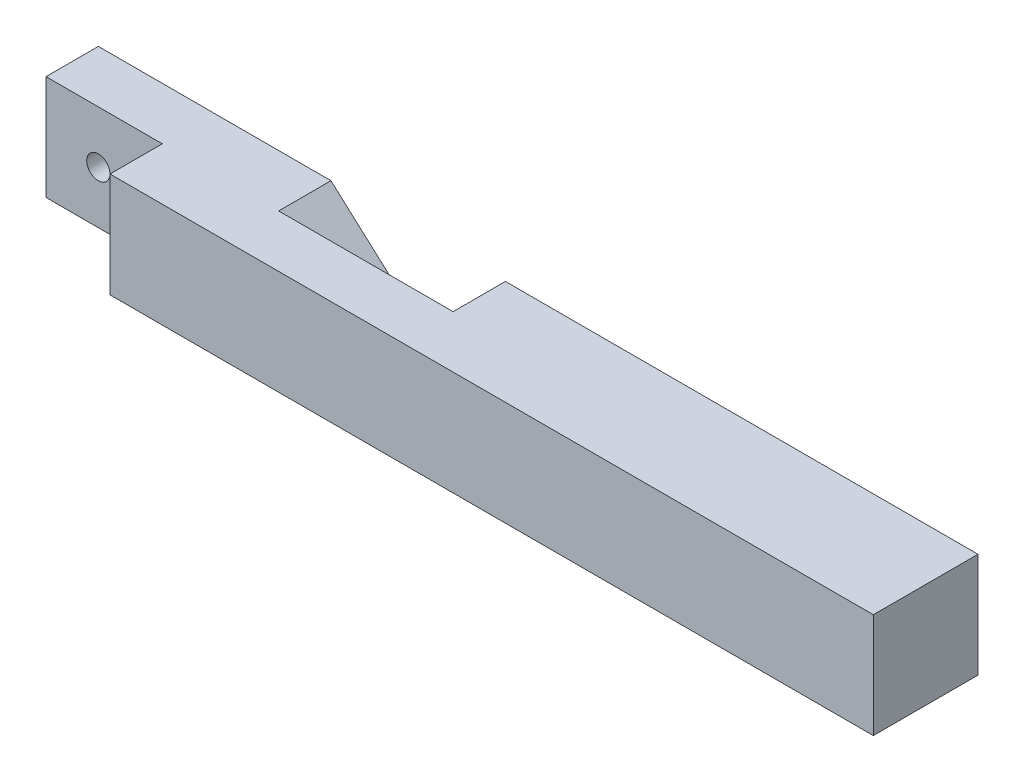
from build123d import *

# Parameters (mm, degrees)
ESQUISSE1_W             = 75.63
ESQUISSE1_H             = 9
EXTRUSION1_DEPTH        = 9
ESQUISSE2_W             = 10
ESQUISSE2_H             = 9
ENL_V_MAT_EXTRU_1_DEPTH = 4.5
ESQUISSE3_R             = 1
ENL_V_MAT_EXTRU_2_DEPTH = 4.5
ENL_V_MAT_EXTRU_3_DEPTH = 4.5


with BuildPart() as part:
    # Esquisse1 → Extrusion1 (new body)
    with BuildSketch(Plane.XY):
        with Locations((37.815, 4.5)):
            Rectangle(ESQUISSE1_W, ESQUISSE1_H)
    extrude(amount=EXTRUSION1_DEPTH)

    # Esquisse2 → Enl_v. mat.-Extru.1 (cut)
    with BuildSketch(Plane.XY.offset(9)):
        with Locations((5, 4.5)):
            Rectangle(ESQUISSE2_W, ESQUISSE2_H)
    extrude(amount=-ENL_V_MAT_EXTRU_1_DEPTH, mode=Mode.SUBTRACT)

    # Esquisse3 → Enl_v. mat.-Extru.2 (cut)
    with BuildSketch(Plane.XY.offset(4.5)):
        with Locations((4.5, 4.5)):
            Circle(ESQUISSE3_R)
    extrude(amount=-ENL_V_MAT_EXTRU_2_DEPTH, mode=Mode.SUBTRACT)

    # Esquisse4 → Enl_v. mat.-Extru.3 (cut)
    with BuildSketch(Plane(origin=(0, 0, 0), x_dir=(-1, 0, 0), z_dir=(0, 0, -1))):
        Polygon((-20, 9), (-25, 4.5), (-20, 0), (-35, 0), (-40, 4.5), (-35, 9), align=None)
    extrude(amount=-ENL_V_MAT_EXTRU_3_DEPTH, mode=Mode.SUBTRACT)


solid = part.part
